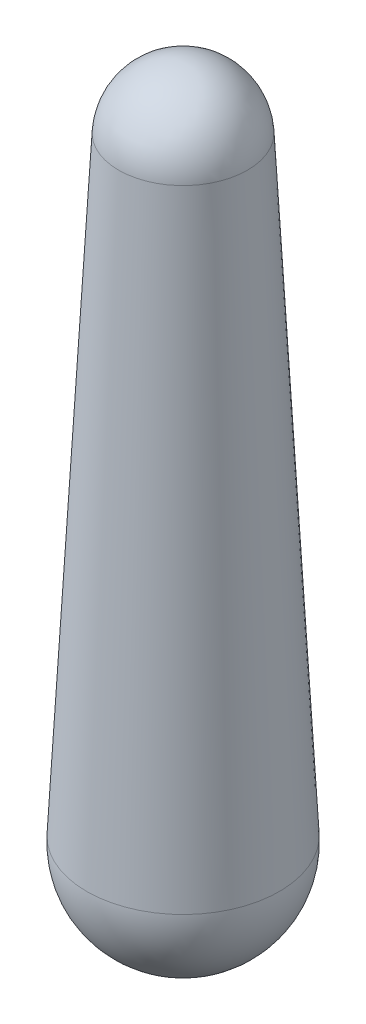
ISO-10303-21;
HEADER;
FILE_DESCRIPTION(('STEP AP214'),'2;1');
FILE_NAME('part.step','',(''),(''),'','','');
FILE_SCHEMA(('AUTOMOTIVE_DESIGN { 1 0 10303 214 1 1 1 1 }'));
ENDSEC;
DATA;
#1=APPLICATION_CONTEXT('core data for automotive mechanical design processes');
#2=APPLICATION_PROTOCOL_DEFINITION('international standard','automotive_design',2000,#1);
#3=PRODUCT_CONTEXT('',#1,'mechanical');
#4=PRODUCT('Part','Part','',(#3));
#5=PRODUCT_RELATED_PRODUCT_CATEGORY('part','',(#4));
#6=PRODUCT_DEFINITION_FORMATION('','',#4);
#7=PRODUCT_DEFINITION_CONTEXT('part definition',#1,'design');
#8=PRODUCT_DEFINITION('design','',#6,#7);
#9=PRODUCT_DEFINITION_SHAPE('','',#8);
#10=(LENGTH_UNIT() NAMED_UNIT(*) SI_UNIT(.MILLI.,.METRE.));
#11=(NAMED_UNIT(*) PLANE_ANGLE_UNIT() SI_UNIT($,.RADIAN.));
#12=(NAMED_UNIT(*) SI_UNIT($,.STERADIAN.) SOLID_ANGLE_UNIT());
#13=UNCERTAINTY_MEASURE_WITH_UNIT(LENGTH_MEASURE(1.E-05),#10,'distance_accuracy_value','');
#14=(GEOMETRIC_REPRESENTATION_CONTEXT(3) GLOBAL_UNCERTAINTY_ASSIGNED_CONTEXT((#13)) GLOBAL_UNIT_ASSIGNED_CONTEXT((#10,
#11,#12)) REPRESENTATION_CONTEXT('',''));
#15=CARTESIAN_POINT('',(0.,0.,0.));
#16=DIRECTION('',(0.,0.,1.));
#17=DIRECTION('',(1.,0.,0.));
#18=AXIS2_PLACEMENT_3D('',#15,#16,#17);
#19=CARTESIAN_POINT('',(0.,5.,0.));
#20=DIRECTION('',(0.,1.,0.));
#21=DIRECTION('',(-1.,0.,0.));
#22=AXIS2_PLACEMENT_3D('',#19,#20,#21);
#23=SPHERICAL_SURFACE('',#22,5.);
#24=CARTESIAN_POINT('',(0.,5.26167978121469,0.));
#25=DIRECTION('',(0.,1.,0.));
#26=DIRECTION('',(0.,0.,1.));
#27=AXIS2_PLACEMENT_3D('',#24,#25,#26);
#28=CIRCLE('',#27,4.99314767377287);
#29=CARTESIAN_POINT('',(0.,5.26167978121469,4.99314767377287));
#30=VERTEX_POINT('',#29);
#31=EDGE_CURVE('E10',#30,#30,#28,.T.);
#32=ORIENTED_EDGE('',*,*,#31,.F.);
#33=EDGE_LOOP('',(#32));
#34=FACE_BOUND('',#33,.T.);
#35=ADVANCED_FACE('F27',(#34),#23,.T.);
#36=CARTESIAN_POINT('',(0.,5.26167978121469,0.));
#37=DIRECTION('',(0.,-1.,0.));
#38=DIRECTION('',(0.,0.,-1.));
#39=AXIS2_PLACEMENT_3D('',#36,#37,#38);
#40=CONICAL_SURFACE('',#39,4.99314767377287,0.0523598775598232);
#41=CARTESIAN_POINT('',(0.,36.8317584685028,0.));
#42=DIRECTION('',(0.,1.,0.));
#43=DIRECTION('',(0.,0.,1.));
#44=AXIS2_PLACEMENT_3D('',#41,#42,#43);
#45=CIRCLE('',#44,3.33862995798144);
#46=CARTESIAN_POINT('',(0.,36.8317584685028,3.33862995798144));
#47=VERTEX_POINT('',#46);
#48=EDGE_CURVE('E33',#47,#47,#45,.T.);
#49=ORIENTED_EDGE('',*,*,#48,.F.);
#50=EDGE_LOOP('',(#49));
#51=FACE_BOUND('',#50,.T.);
#52=ORIENTED_EDGE('',*,*,#31,.T.);
#53=EDGE_LOOP('',(#52));
#54=FACE_BOUND('',#53,.T.);
#55=ADVANCED_FACE('F41',(#51,#54),#40,.T.);
#56=CARTESIAN_POINT('',(0.,36.6567882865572,0.));
#57=DIRECTION('',(0.,1.,0.));
#58=DIRECTION('',(1.,0.,0.));
#59=AXIS2_PLACEMENT_3D('',#56,#57,#58);
#60=SPHERICAL_SURFACE('',#59,3.34321171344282);
#61=ORIENTED_EDGE('',*,*,#48,.T.);
#62=EDGE_LOOP('',(#61));
#63=FACE_BOUND('',#62,.T.);
#64=ADVANCED_FACE('F39',(#63),#60,.T.);
#65=CLOSED_SHELL('',(#35,#55,#64));
#66=MANIFOLD_SOLID_BREP('B2',#65);
#67=ADVANCED_BREP_SHAPE_REPRESENTATION('',(#18,#66),#14);
#68=SHAPE_DEFINITION_REPRESENTATION(#9,#67);
ENDSEC;
END-ISO-10303-21;
